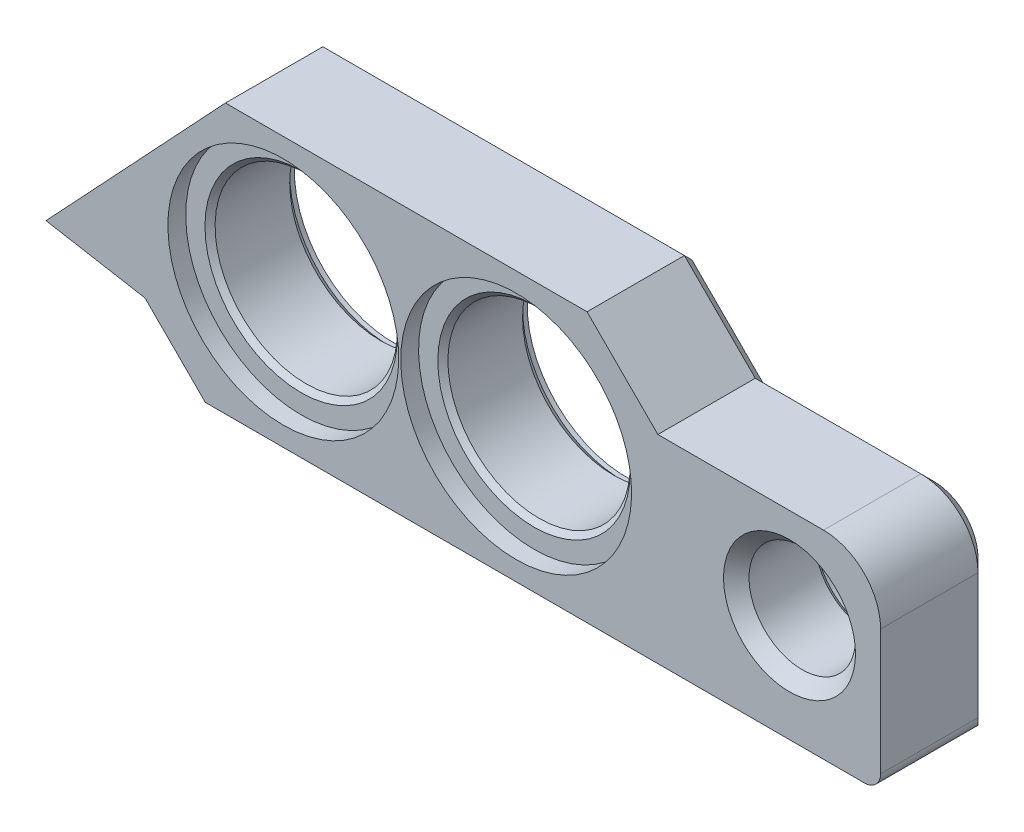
ISO-10303-21;
HEADER;
FILE_DESCRIPTION(('STEP AP214'),'2;1');
FILE_NAME('part.step','',(''),(''),'','','');
FILE_SCHEMA(('AUTOMOTIVE_DESIGN { 1 0 10303 214 1 1 1 1 }'));
ENDSEC;
DATA;
#1=APPLICATION_CONTEXT('core data for automotive mechanical design processes');
#2=APPLICATION_PROTOCOL_DEFINITION('international standard','automotive_design',2000,#1);
#3=PRODUCT_CONTEXT('',#1,'mechanical');
#4=PRODUCT('Part','Part','',(#3));
#5=PRODUCT_RELATED_PRODUCT_CATEGORY('part','',(#4));
#6=PRODUCT_DEFINITION_FORMATION('','',#4);
#7=PRODUCT_DEFINITION_CONTEXT('part definition',#1,'design');
#8=PRODUCT_DEFINITION('design','',#6,#7);
#9=PRODUCT_DEFINITION_SHAPE('','',#8);
#10=(LENGTH_UNIT() NAMED_UNIT(*) SI_UNIT(.MILLI.,.METRE.));
#11=(NAMED_UNIT(*) PLANE_ANGLE_UNIT() SI_UNIT($,.RADIAN.));
#12=(NAMED_UNIT(*) SI_UNIT($,.STERADIAN.) SOLID_ANGLE_UNIT());
#13=UNCERTAINTY_MEASURE_WITH_UNIT(LENGTH_MEASURE(1.E-05),#10,'distance_accuracy_value','');
#14=(GEOMETRIC_REPRESENTATION_CONTEXT(3) GLOBAL_UNCERTAINTY_ASSIGNED_CONTEXT((#13)) GLOBAL_UNIT_ASSIGNED_CONTEXT((#10,
#11,#12)) REPRESENTATION_CONTEXT('',''));
#15=CARTESIAN_POINT('',(0.,0.,0.));
#16=DIRECTION('',(0.,0.,1.));
#17=DIRECTION('',(1.,0.,0.));
#18=AXIS2_PLACEMENT_3D('',#15,#16,#17);
#19=CARTESIAN_POINT('',(-78.2694281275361,37.4141999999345,102.518069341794));
#20=DIRECTION('',(0.,1.41706785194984E-12,-1.));
#21=DIRECTION('',(0.,1.,1.41706785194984E-12));
#22=AXIS2_PLACEMENT_3D('',#19,#20,#21);
#23=CYLINDRICAL_SURFACE('',#22,3.3377);
#24=CARTESIAN_POINT('',(-78.2694281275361,37.4141999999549,88.1458282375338));
#25=DIRECTION('',(0.,1.41329641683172E-12,-1.));
#26=DIRECTION('',(0.,1.,1.41329641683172E-12));
#27=AXIS2_PLACEMENT_3D('',#24,#25,#26);
#28=CIRCLE('',#27,3.3377);
#29=CARTESIAN_POINT('',(-78.2694281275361,40.7518999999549,88.1458282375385));
#30=VERTEX_POINT('',#29);
#31=EDGE_CURVE('E75',#30,#30,#28,.T.);
#32=ORIENTED_EDGE('',*,*,#31,.T.);
#33=EDGE_LOOP('',(#32));
#34=FACE_BOUND('',#33,.T.);
#35=CARTESIAN_POINT('',(-78.2694281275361,37.414199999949,92.2776282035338));
#36=DIRECTION('',(0.,1.4137997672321E-12,-1.));
#37=DIRECTION('',(0.,1.,1.41379976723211E-12));
#38=AXIS2_PLACEMENT_3D('',#35,#36,#37);
#39=CIRCLE('',#38,3.3377);
#40=CARTESIAN_POINT('',(-78.2694281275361,40.751899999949,92.2776282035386));
#41=VERTEX_POINT('',#40);
#42=EDGE_CURVE('E382',#41,#41,#39,.F.);
#43=ORIENTED_EDGE('',*,*,#42,.T.);
#44=EDGE_LOOP('',(#43));
#45=FACE_BOUND('',#44,.T.);
#46=ADVANCED_FACE('F66',(#34,#45),#23,.F.);
#47=CARTESIAN_POINT('',(-110.019428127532,39.1266999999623,86.1688281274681));
#48=DIRECTION('',(0.,-1.41722377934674E-12,1.));
#49=DIRECTION('',(0.,-1.,-1.41722377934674E-12));
#50=AXIS2_PLACEMENT_3D('',#47,#48,#49);
#51=CYLINDRICAL_SURFACE('',#50,5.71499999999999);
#52=CARTESIAN_POINT('',(-110.019428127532,39.1266999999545,91.6425281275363));
#53=DIRECTION('',(0.,-1.42056095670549E-12,1.));
#54=DIRECTION('',(0.,-1.,-1.42056095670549E-12));
#55=AXIS2_PLACEMENT_3D('',#52,#53,#54);
#56=CIRCLE('',#55,5.71499999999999);
#57=CARTESIAN_POINT('',(-110.019428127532,33.4116999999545,91.6425281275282));
#58=VERTEX_POINT('',#57);
#59=EDGE_CURVE('E370',#58,#58,#56,.T.);
#60=ORIENTED_EDGE('',*,*,#59,.T.);
#61=EDGE_LOOP('',(#60));
#62=FACE_BOUND('',#61,.T.);
#63=CARTESIAN_POINT('',(-110.019428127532,39.1266999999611,86.9618281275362));
#64=DIRECTION('',(0.,1.41329663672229E-12,-1.));
#65=DIRECTION('',(0.,1.,1.41329663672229E-12));
#66=AXIS2_PLACEMENT_3D('',#63,#64,#65);
#67=CIRCLE('',#66,5.71499999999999);
#68=CARTESIAN_POINT('',(-110.019428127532,44.8416999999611,86.9618281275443));
#69=VERTEX_POINT('',#68);
#70=EDGE_CURVE('E254',#69,#69,#67,.T.);
#71=ORIENTED_EDGE('',*,*,#70,.T.);
#72=EDGE_LOOP('',(#71));
#73=FACE_BOUND('',#72,.T.);
#74=ADVANCED_FACE('F515',(#62,#73),#51,.F.);
#75=CARTESIAN_POINT('',(-95.4144281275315,39.1266999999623,86.1688281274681));
#76=DIRECTION('',(0.,-1.41722377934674E-12,1.));
#77=DIRECTION('',(0.,-1.,-1.41722377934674E-12));
#78=AXIS2_PLACEMENT_3D('',#75,#76,#77);
#79=CYLINDRICAL_SURFACE('',#78,5.71499999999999);
#80=CARTESIAN_POINT('',(-95.4144281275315,39.1266999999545,91.6425281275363));
#81=DIRECTION('',(0.,-1.42056095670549E-12,1.));
#82=DIRECTION('',(0.,-1.,-1.42056095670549E-12));
#83=AXIS2_PLACEMENT_3D('',#80,#81,#82);
#84=CIRCLE('',#83,5.71499999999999);
#85=CARTESIAN_POINT('',(-95.4144281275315,33.4116999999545,91.6425281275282));
#86=VERTEX_POINT('',#85);
#87=EDGE_CURVE('E378',#86,#86,#84,.T.);
#88=ORIENTED_EDGE('',*,*,#87,.T.);
#89=EDGE_LOOP('',(#88));
#90=FACE_BOUND('',#89,.T.);
#91=CARTESIAN_POINT('',(-95.4144281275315,39.1266999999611,86.9618281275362));
#92=DIRECTION('',(0.,1.41329663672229E-12,-1.));
#93=DIRECTION('',(0.,1.,1.41329663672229E-12));
#94=AXIS2_PLACEMENT_3D('',#91,#92,#93);
#95=CIRCLE('',#94,5.71499999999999);
#96=CARTESIAN_POINT('',(-95.4144281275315,44.8416999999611,86.9618281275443));
#97=VERTEX_POINT('',#96);
#98=EDGE_CURVE('E258',#97,#97,#95,.T.);
#99=ORIENTED_EDGE('',*,*,#98,.T.);
#100=EDGE_LOOP('',(#99));
#101=FACE_BOUND('',#100,.T.);
#102=ADVANCED_FACE('F520',(#90,#101),#79,.F.);
#103=CARTESIAN_POINT('',(-97.3194281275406,30.4291999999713,86.1688281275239));
#104=DIRECTION('',(0.,-1.41706785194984E-12,1.));
#105=DIRECTION('',(-1.,7.15679251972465E-13,0.));
#106=AXIS2_PLACEMENT_3D('',#103,#104,#105);
#107=PLANE('',#106);
#108=CARTESIAN_POINT('',(-78.2694281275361,37.4141999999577,86.1688281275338));
#109=DIRECTION('',(0.,1.41706785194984E-12,-1.));
#110=DIRECTION('',(0.,1.,1.41706785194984E-12));
#111=AXIS2_PLACEMENT_3D('',#108,#109,#110);
#112=CIRCLE('',#111,3.687699);
#113=CARTESIAN_POINT('',(-78.2694281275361,41.1018989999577,86.1688281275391));
#114=VERTEX_POINT('',#113);
#115=EDGE_CURVE('E324',#114,#114,#112,.T.);
#116=ORIENTED_EDGE('',*,*,#115,.F.);
#117=EDGE_LOOP('',(#116));
#118=FACE_BOUND('',#117,.T.);
#119=DIRECTION('',(0.707106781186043,-0.707106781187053,-1.0020182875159E-12));
#120=VECTOR('',#119,1.);
#121=CARTESIAN_POINT('',(-86.1376135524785,41.6110145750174,86.1688281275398));
#122=LINE('',#121,#120);
#123=CARTESIAN_POINT('',(-91.3007989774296,46.7741999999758,86.1688281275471));
#124=VERTEX_POINT('',#123);
#125=CARTESIAN_POINT('',(-86.8557989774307,42.3291999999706,86.1688281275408));
#126=VERTEX_POINT('',#125);
#127=EDGE_CURVE('E281',#124,#126,#122,.T.);
#128=ORIENTED_EDGE('',*,*,#127,.T.);
#129=DIRECTION('',(1.,-7.15679251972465E-13,0.));
#130=VECTOR('',#129,1.);
#131=CARTESIAN_POINT('',(-76.1365272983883,42.329199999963,86.1688281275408));
#132=LINE('',#131,#130);
#133=CARTESIAN_POINT('',(-76.1365272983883,42.3291999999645,86.1688281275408));
#134=VERTEX_POINT('',#133);
#135=EDGE_CURVE('E287',#126,#134,#132,.T.);
#136=ORIENTED_EDGE('',*,*,#135,.T.);
#137=CARTESIAN_POINT('',(-76.1365272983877,39.547100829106,86.1688281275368));
#138=DIRECTION('',(0.,-1.41706785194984E-12,1.));
#139=DIRECTION('',(0.,-1.,-1.41706785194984E-12));
#140=AXIS2_PLACEMENT_3D('',#137,#138,#139);
#141=CIRCLE('',#140,2.78209917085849);
#142=CARTESIAN_POINT('',(-73.3544281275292,39.547100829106,86.1688281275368));
#143=VERTEX_POINT('',#142);
#144=EDGE_CURVE('E284',#134,#143,#141,.F.);
#145=ORIENTED_EDGE('',*,*,#144,.T.);
#146=DIRECTION('',(0.,-1.,-1.41706785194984E-12));
#147=VECTOR('',#146,1.);
#148=CARTESIAN_POINT('',(-73.3544281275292,30.4291999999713,86.1688281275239));
#149=LINE('',#148,#147);
#150=CARTESIAN_POINT('',(-73.3544281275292,31.4791999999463,86.1688281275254));
#151=VERTEX_POINT('',#150);
#152=EDGE_CURVE('E265',#143,#151,#149,.T.);
#153=ORIENTED_EDGE('',*,*,#152,.T.);
#154=DIRECTION('',(-1.,0.,0.));
#155=VECTOR('',#154,1.);
#156=CARTESIAN_POINT('',(-97.3194281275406,31.4791999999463,86.1688281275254));
#157=LINE('',#156,#155);
#158=CARTESIAN_POINT('',(-114.581358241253,31.4791999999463,86.1688281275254));
#159=VERTEX_POINT('',#158);
#160=EDGE_CURVE('E262',#151,#159,#157,.T.);
#161=ORIENTED_EDGE('',*,*,#160,.T.);
#162=DIRECTION('',(-0.707106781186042,0.707106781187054,1.0020182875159E-12));
#163=VECTOR('',#162,1.);
#164=CARTESIAN_POINT('',(-105.425393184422,22.3232349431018,86.1688281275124));
#165=LINE('',#164,#163);
#166=CARTESIAN_POINT('',(-118.30581037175,35.2036521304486,86.1688281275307));
#167=VERTEX_POINT('',#166);
#168=EDGE_CURVE('E269',#159,#167,#165,.T.);
#169=ORIENTED_EDGE('',*,*,#168,.T.);
#170=DIRECTION('',(-0.984807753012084,0.173648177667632,2.46071250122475E-13));
#171=VECTOR('',#170,1.);
#172=CARTESIAN_POINT('',(-97.1357655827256,31.4708020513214,86.1688281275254));
#173=LINE('',#172,#171);
#174=CARTESIAN_POINT('',(-123.311619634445,36.0863113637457,86.168828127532));
#175=VERTEX_POINT('',#174);
#176=EDGE_CURVE('E272',#167,#175,#173,.T.);
#177=ORIENTED_EDGE('',*,*,#176,.T.);
#178=DIRECTION('',(0.68351636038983,0.729935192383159,1.034367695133E-12));
#179=VECTOR('',#178,1.);
#180=CARTESIAN_POINT('',(-113.066320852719,47.0273869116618,86.1688281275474));
#181=LINE('',#180,#179);
#182=CARTESIAN_POINT('',(-113.303406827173,46.7741999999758,86.1688281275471));
#183=VERTEX_POINT('',#182);
#184=EDGE_CURVE('E275',#175,#183,#181,.T.);
#185=ORIENTED_EDGE('',*,*,#184,.T.);
#186=DIRECTION('',(1.,0.,0.));
#187=VECTOR('',#186,1.);
#188=CARTESIAN_POINT('',(-90.9694281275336,46.7741999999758,86.1688281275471));
#189=LINE('',#188,#187);
#190=EDGE_CURVE('E278',#183,#124,#189,.T.);
#191=ORIENTED_EDGE('',*,*,#190,.T.);
#192=EDGE_LOOP('',(#128,#136,#145,#153,#161,#169,#177,#185,#191));
#193=FACE_BOUND('',#192,.T.);
#194=CARTESIAN_POINT('',(-110.019428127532,39.1266999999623,86.1688281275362));
#195=DIRECTION('',(0.,1.41706785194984E-12,-1.));
#196=DIRECTION('',(0.,1.,1.41706785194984E-12));
#197=AXIS2_PLACEMENT_3D('',#194,#195,#196);
#198=CIRCLE('',#197,6.21499999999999);
#199=CARTESIAN_POINT('',(-110.019428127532,45.3416999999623,86.1688281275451));
#200=VERTEX_POINT('',#199);
#201=EDGE_CURVE('E420',#200,#200,#198,.T.);
#202=ORIENTED_EDGE('',*,*,#201,.F.);
#203=EDGE_LOOP('',(#202));
#204=FACE_BOUND('',#203,.T.);
#205=CARTESIAN_POINT('',(-95.4144281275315,39.1266999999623,86.1688281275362));
#206=DIRECTION('',(0.,1.41706785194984E-12,-1.));
#207=DIRECTION('',(0.,1.,1.41706785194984E-12));
#208=AXIS2_PLACEMENT_3D('',#205,#206,#207);
#209=CIRCLE('',#208,6.21499999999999);
#210=CARTESIAN_POINT('',(-95.4144281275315,45.3416999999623,86.1688281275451));
#211=VERTEX_POINT('',#210);
#212=EDGE_CURVE('E435',#211,#211,#209,.T.);
#213=ORIENTED_EDGE('',*,*,#212,.F.);
#214=EDGE_LOOP('',(#213));
#215=FACE_BOUND('',#214,.T.);
#216=ADVANCED_FACE('F460',(#118,#193,#204,#215),#107,.F.);
#217=CARTESIAN_POINT('',(-100.494428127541,30.4291999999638,93.0776281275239));
#218=DIRECTION('',(0.,1.41722377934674E-12,-1.));
#219=DIRECTION('',(7.15679251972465E-13,1.,1.41722377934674E-12));
#220=AXIS2_PLACEMENT_3D('',#217,#218,#219);
#221=PLANE('',#220);
#222=CARTESIAN_POINT('',(-78.2694281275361,37.4141999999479,93.0776281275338));
#223=DIRECTION('',(0.,1.41722377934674E-12,-1.));
#224=DIRECTION('',(0.,1.,1.41722377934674E-12));
#225=AXIS2_PLACEMENT_3D('',#222,#223,#224);
#226=CIRCLE('',#225,4.13769992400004);
#227=CARTESIAN_POINT('',(-78.2694281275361,41.5518999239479,93.0776281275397));
#228=VERTEX_POINT('',#227);
#229=EDGE_CURVE('E386',#228,#228,#226,.T.);
#230=ORIENTED_EDGE('',*,*,#229,.T.);
#231=EDGE_LOOP('',(#230));
#232=FACE_BOUND('',#231,.T.);
#233=CARTESIAN_POINT('',(-95.4144281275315,39.1266999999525,93.0776281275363));
#234=DIRECTION('',(0.,-1.41722377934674E-12,1.));
#235=DIRECTION('',(0.,-1.,-1.41722377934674E-12));
#236=AXIS2_PLACEMENT_3D('',#233,#234,#235);
#237=CIRCLE('',#236,7.239);
#238=CARTESIAN_POINT('',(-95.4144281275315,31.8876999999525,93.077628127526));
#239=VERTEX_POINT('',#238);
#240=EDGE_CURVE('E421',#239,#239,#237,.T.);
#241=ORIENTED_EDGE('',*,*,#240,.F.);
#242=EDGE_LOOP('',(#241));
#243=FACE_BOUND('',#242,.T.);
#244=CARTESIAN_POINT('',(-110.019428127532,39.1266999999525,93.0776281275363));
#245=DIRECTION('',(0.,-1.41722377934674E-12,1.));
#246=DIRECTION('',(0.,-1.,-1.41722377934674E-12));
#247=AXIS2_PLACEMENT_3D('',#244,#245,#246);
#248=CIRCLE('',#247,7.239);
#249=CARTESIAN_POINT('',(-110.019428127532,31.8876999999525,93.077628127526));
#250=VERTEX_POINT('',#249);
#251=EDGE_CURVE('E415',#250,#250,#248,.T.);
#252=ORIENTED_EDGE('',*,*,#251,.F.);
#253=EDGE_LOOP('',(#252));
#254=FACE_BOUND('',#253,.T.);
#255=DIRECTION('',(1.,0.,0.));
#256=VECTOR('',#255,1.);
#257=CARTESIAN_POINT('',(-100.494428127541,30.6791999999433,93.0776281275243));
#258=LINE('',#257,#256);
#259=CARTESIAN_POINT('',(-114.912729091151,30.6791999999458,93.0776281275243));
#260=VERTEX_POINT('',#259);
#261=CARTESIAN_POINT('',(-73.5544281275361,30.6791999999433,93.0776281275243));
#262=VERTEX_POINT('',#261);
#263=EDGE_CURVE('E227',#260,#262,#258,.T.);
#264=ORIENTED_EDGE('',*,*,#263,.T.);
#265=CARTESIAN_POINT('',(-73.5544281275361,31.6791999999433,93.0776281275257));
#266=DIRECTION('',(0.,1.41722377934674E-12,-1.));
#267=DIRECTION('',(0.,1.,1.41722377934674E-12));
#268=AXIS2_PLACEMENT_3D('',#265,#266,#267);
#269=CIRCLE('',#268,1.);
#270=CARTESIAN_POINT('',(-72.5544281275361,31.6791999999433,93.0776281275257));
#271=VERTEX_POINT('',#270);
#272=EDGE_CURVE('E356',#262,#271,#269,.F.);
#273=ORIENTED_EDGE('',*,*,#272,.T.);
#274=DIRECTION('',(0.,1.,1.41891425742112E-12));
#275=VECTOR('',#274,1.);
#276=CARTESIAN_POINT('',(-72.5544281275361,36.7791999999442,93.0776281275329));
#277=LINE('',#276,#275);
#278=CARTESIAN_POINT('',(-72.5544281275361,39.5471008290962,93.0776281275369));
#279=VERTEX_POINT('',#278);
#280=EDGE_CURVE('E211',#271,#279,#277,.T.);
#281=ORIENTED_EDGE('',*,*,#280,.T.);
#282=CARTESIAN_POINT('',(-76.1365272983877,39.5471008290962,93.0776281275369));
#283=DIRECTION('',(0.,-1.41722377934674E-12,1.));
#284=DIRECTION('',(0.,1.,1.41722377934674E-12));
#285=AXIS2_PLACEMENT_3D('',#282,#283,#284);
#286=CIRCLE('',#285,3.58209917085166);
#287=CARTESIAN_POINT('',(-76.1365272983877,43.1291999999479,93.0776281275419));
#288=VERTEX_POINT('',#287);
#289=EDGE_CURVE('E200',#279,#288,#286,.T.);
#290=ORIENTED_EDGE('',*,*,#289,.T.);
#291=DIRECTION('',(-1.,7.1700502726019E-13,0.));
#292=VECTOR('',#291,1.);
#293=CARTESIAN_POINT('',(-86.5244281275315,43.1291999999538,93.0776281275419));
#294=LINE('',#293,#292);
#295=CARTESIAN_POINT('',(-86.5244281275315,43.1291999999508,93.0776281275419));
#296=VERTEX_POINT('',#295);
#297=EDGE_CURVE('E198',#288,#296,#294,.T.);
#298=ORIENTED_EDGE('',*,*,#297,.T.);
#299=DIRECTION('',(-0.707106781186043,0.707106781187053,1.00212854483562E-12));
#300=VECTOR('',#299,1.);
#301=CARTESIAN_POINT('',(-87.1594281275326,43.7641999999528,93.0776281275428));
#302=LINE('',#301,#300);
#303=CARTESIAN_POINT('',(-90.9694281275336,47.5741999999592,93.0776281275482));
#304=VERTEX_POINT('',#303);
#305=EDGE_CURVE('E178',#296,#304,#302,.T.);
#306=ORIENTED_EDGE('',*,*,#305,.T.);
#307=DIRECTION('',(-1.,0.,0.));
#308=VECTOR('',#307,1.);
#309=CARTESIAN_POINT('',(-113.650269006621,47.5741999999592,93.0776281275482));
#310=LINE('',#309,#308);
#311=CARTESIAN_POINT('',(-113.650269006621,47.5741999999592,93.0776281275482));
#312=VERTEX_POINT('',#311);
#313=EDGE_CURVE('E194',#304,#312,#310,.T.);
#314=ORIENTED_EDGE('',*,*,#313,.T.);
#315=DIRECTION('',(-0.683516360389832,-0.729935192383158,-1.02894114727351E-12));
#316=VECTOR('',#315,1.);
#317=CARTESIAN_POINT('',(-114.839505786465,46.304199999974,93.0776281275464));
#318=LINE('',#317,#316);
#319=CARTESIAN_POINT('',(-124.905171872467,35.554956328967,93.0776281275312));
#320=VERTEX_POINT('',#319);
#321=EDGE_CURVE('E206',#312,#320,#318,.T.);
#322=ORIENTED_EDGE('',*,*,#321,.T.);
#323=DIRECTION('',(0.984807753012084,-0.173648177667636,-2.4607125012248E-13));
#324=VECTOR('',#323,1.);
#325=CARTESIAN_POINT('',(-123.865493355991,35.3716329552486,93.0776281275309));
#326=LINE('',#325,#324);
#327=CARTESIAN_POINT('',(-118.693135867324,34.4596067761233,93.0776281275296));
#328=VERTEX_POINT('',#327);
#329=EDGE_CURVE('E230',#320,#328,#326,.T.);
#330=ORIENTED_EDGE('',*,*,#329,.T.);
#331=DIRECTION('',(0.707106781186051,-0.707106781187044,-1.00201828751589E-12));
#332=VECTOR('',#331,1.);
#333=CARTESIAN_POINT('',(-114.751117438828,30.5175883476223,93.0776281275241));
#334=LINE('',#333,#332);
#335=EDGE_CURVE('E234',#328,#260,#334,.T.);
#336=ORIENTED_EDGE('',*,*,#335,.T.);
#337=EDGE_LOOP('',(#264,#273,#281,#290,#298,#306,#314,#322,#330,#336));
#338=FACE_BOUND('',#337,.T.);
#339=ADVANCED_FACE('F192',(#232,#243,#254,#338),#221,.F.);
#340=CARTESIAN_POINT('',(-78.2694281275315,43.1292000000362,30.7583099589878));
#341=DIRECTION('',(7.15679251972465E-13,1.,1.41722377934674E-12));
#342=DIRECTION('',(0.,-1.41722377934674E-12,1.));
#343=AXIS2_PLACEMENT_3D('',#340,#341,#342);
#344=PLANE('',#343);
#345=DIRECTION('',(0.,-1.41722377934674E-12,1.));
#346=VECTOR('',#345,1.);
#347=CARTESIAN_POINT('',(-76.1365272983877,43.1291999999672,79.4240034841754));
#348=LINE('',#347,#346);
#349=CARTESIAN_POINT('',(-76.1365272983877,43.1291999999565,86.9688281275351));
#350=VERTEX_POINT('',#349);
#351=EDGE_CURVE('E412',#350,#288,#348,.T.);
#352=ORIENTED_EDGE('',*,*,#351,.F.);
#353=DIRECTION('',(-1.,7.15679251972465E-13,0.));
#354=VECTOR('',#353,1.);
#355=CARTESIAN_POINT('',(-86.5244281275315,43.1291999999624,86.9688281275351));
#356=LINE('',#355,#354);
#357=CARTESIAN_POINT('',(-86.5244281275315,43.1291999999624,86.9688281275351));
#358=VERTEX_POINT('',#357);
#359=EDGE_CURVE('E291',#350,#358,#356,.T.);
#360=ORIENTED_EDGE('',*,*,#359,.T.);
#361=DIRECTION('',(0.,1.41722377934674E-12,-1.));
#362=VECTOR('',#361,1.);
#363=CARTESIAN_POINT('',(-86.5244281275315,43.1292000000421,30.7583099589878));
#364=LINE('',#363,#362);
#365=EDGE_CURVE('E217',#296,#358,#364,.T.);
#366=ORIENTED_EDGE('',*,*,#365,.F.);
#367=ORIENTED_EDGE('',*,*,#297,.F.);
#368=EDGE_LOOP('',(#352,#360,#366,#367));
#369=FACE_BOUND('',#368,.T.);
#370=ADVANCED_FACE('F449',(#369),#344,.T.);
#371=CARTESIAN_POINT('',(-125.007184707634,35.4460156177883,30.758309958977));
#372=DIRECTION('',(-0.72993519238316,0.68351636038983,9.68695639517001E-13));
#373=DIRECTION('',(0.68351636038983,0.72993519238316,1.034367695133E-12));
#374=AXIS2_PLACEMENT_3D('',#371,#372,#373);
#375=PLANE('',#374);
#376=DIRECTION('',(0.,-1.41722377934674E-12,1.));
#377=VECTOR('',#376,1.);
#378=CARTESIAN_POINT('',(-113.650269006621,47.574200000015,53.7071700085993));
#379=LINE('',#378,#377);
#380=CARTESIAN_POINT('',(-113.650269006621,47.5741999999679,86.9688281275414));
#381=VERTEX_POINT('',#380);
#382=EDGE_CURVE('E204',#381,#312,#379,.T.);
#383=ORIENTED_EDGE('',*,*,#382,.F.);
#384=DIRECTION('',(-0.68351636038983,-0.72993519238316,-1.034367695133E-12));
#385=VECTOR('',#384,1.);
#386=CARTESIAN_POINT('',(-124.905171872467,35.5549563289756,86.9688281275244));
#387=LINE('',#386,#385);
#388=CARTESIAN_POINT('',(-124.905171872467,35.5549563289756,86.9688281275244));
#389=VERTEX_POINT('',#388);
#390=EDGE_CURVE('E303',#381,#389,#387,.T.);
#391=ORIENTED_EDGE('',*,*,#390,.T.);
#392=DIRECTION('',(0.,1.41708994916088E-12,-1.));
#393=VECTOR('',#392,1.);
#394=CARTESIAN_POINT('',(-124.905171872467,35.5549563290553,30.7583099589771));
#395=LINE('',#394,#393);
#396=EDGE_CURVE('E242',#320,#389,#395,.T.);
#397=ORIENTED_EDGE('',*,*,#396,.F.);
#398=ORIENTED_EDGE('',*,*,#321,.F.);
#399=EDGE_LOOP('',(#383,#391,#397,#398));
#400=FACE_BOUND('',#399,.T.);
#401=ADVANCED_FACE('F472',(#400),#375,.T.);
#402=CARTESIAN_POINT('',(-114.751117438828,30.5175883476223,93.0776281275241));
#403=DIRECTION('',(0.707106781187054,0.707106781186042,1.00201828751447E-12));
#404=DIRECTION('',(0.707106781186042,-0.707106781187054,-1.0020182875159E-12));
#405=AXIS2_PLACEMENT_3D('',#402,#403,#404);
#406=PLANE('',#405);
#407=DIRECTION('',(0.,1.41706785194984E-12,-1.));
#408=VECTOR('',#407,1.);
#409=CARTESIAN_POINT('',(-118.693135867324,34.4596067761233,93.0776281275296));
#410=LINE('',#409,#408);
#411=CARTESIAN_POINT('',(-118.693135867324,34.4596067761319,86.9688281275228));
#412=VERTEX_POINT('',#411);
#413=EDGE_CURVE('E238',#328,#412,#410,.T.);
#414=ORIENTED_EDGE('',*,*,#413,.T.);
#415=DIRECTION('',(0.707106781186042,-0.707106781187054,-1.0020182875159E-12));
#416=VECTOR('',#415,1.);
#417=CARTESIAN_POINT('',(-114.751117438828,30.517588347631,86.9688281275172));
#418=LINE('',#417,#416);
#419=CARTESIAN_POINT('',(-114.912729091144,30.679199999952,86.9688281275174));
#420=VERTEX_POINT('',#419);
#421=EDGE_CURVE('E309',#412,#420,#418,.T.);
#422=ORIENTED_EDGE('',*,*,#421,.T.);
#423=DIRECTION('',(0.,-1.41722377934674E-12,1.));
#424=VECTOR('',#423,1.);
#425=CARTESIAN_POINT('',(-114.912729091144,30.6791999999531,86.1688281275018));
#426=LINE('',#425,#424);
#427=EDGE_CURVE('E224',#420,#260,#426,.T.);
#428=ORIENTED_EDGE('',*,*,#427,.T.);
#429=ORIENTED_EDGE('',*,*,#335,.F.);
#430=EDGE_LOOP('',(#414,#422,#428,#429));
#431=FACE_BOUND('',#430,.T.);
#432=ADVANCED_FACE('F488',(#431),#406,.F.);
#433=CARTESIAN_POINT('',(-118.693135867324,34.4596067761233,93.0776281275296));
#434=DIRECTION('',(0.173648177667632,0.984807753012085,1.39553940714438E-12));
#435=DIRECTION('',(0.984807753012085,-0.173648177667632,-2.46071250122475E-13));
#436=AXIS2_PLACEMENT_3D('',#433,#434,#435);
#437=PLANE('',#436);
#438=ORIENTED_EDGE('',*,*,#396,.T.);
#439=DIRECTION('',(0.984807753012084,-0.173648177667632,-2.46071250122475E-13));
#440=VECTOR('',#439,1.);
#441=CARTESIAN_POINT('',(-118.693135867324,34.4596067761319,86.9688281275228));
#442=LINE('',#441,#440);
#443=EDGE_CURVE('E306',#389,#412,#442,.T.);
#444=ORIENTED_EDGE('',*,*,#443,.T.);
#445=ORIENTED_EDGE('',*,*,#413,.F.);
#446=ORIENTED_EDGE('',*,*,#329,.F.);
#447=EDGE_LOOP('',(#438,#444,#445,#446));
#448=FACE_BOUND('',#447,.T.);
#449=ADVANCED_FACE('F484',(#448),#437,.F.);
#450=CARTESIAN_POINT('',(-114.912729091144,30.6791999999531,86.1688281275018));
#451=DIRECTION('',(0.,1.,1.41722377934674E-12));
#452=DIRECTION('',(0.,-1.41722377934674E-12,1.));
#453=AXIS2_PLACEMENT_3D('',#450,#451,#452);
#454=PLANE('',#453);
#455=DIRECTION('',(1.,0.,0.));
#456=VECTOR('',#455,1.);
#457=CARTESIAN_POINT('',(-114.912729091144,30.679199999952,86.9688281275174));
#458=LINE('',#457,#456);
#459=CARTESIAN_POINT('',(-73.5544281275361,30.679199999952,86.9688281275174));
#460=VERTEX_POINT('',#459);
#461=EDGE_CURVE('E315',#420,#460,#458,.T.);
#462=ORIENTED_EDGE('',*,*,#461,.T.);
#463=DIRECTION('',(0.,-1.41722377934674E-12,1.));
#464=VECTOR('',#463,1.);
#465=CARTESIAN_POINT('',(-73.5544281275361,30.6791999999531,86.1688281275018));
#466=LINE('',#465,#464);
#467=EDGE_CURVE('E319',#460,#262,#466,.T.);
#468=ORIENTED_EDGE('',*,*,#467,.T.);
#469=ORIENTED_EDGE('',*,*,#263,.F.);
#470=ORIENTED_EDGE('',*,*,#427,.F.);
#471=EDGE_LOOP('',(#462,#468,#469,#470));
#472=FACE_BOUND('',#471,.T.);
#473=ADVANCED_FACE('F492',(#472),#454,.F.);
#474=CARTESIAN_POINT('',(-72.5544281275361,30.6791999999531,86.1688281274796));
#475=DIRECTION('',(-1.,0.,0.));
#476=DIRECTION('',(0.,0.,1.));
#477=AXIS2_PLACEMENT_3D('',#474,#475,#476);
#478=PLANE('',#477);
#479=ORIENTED_EDGE('',*,*,#280,.F.);
#480=DIRECTION('',(0.,-1.41722377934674E-12,1.));
#481=VECTOR('',#480,1.);
#482=CARTESIAN_POINT('',(-72.5544281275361,31.6791999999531,86.168828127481));
#483=LINE('',#482,#481);
#484=CARTESIAN_POINT('',(-72.5544281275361,31.679199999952,86.9688281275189));
#485=VERTEX_POINT('',#484);
#486=EDGE_CURVE('E90',#271,#485,#483,.F.);
#487=ORIENTED_EDGE('',*,*,#486,.T.);
#488=DIRECTION('',(0.,1.,1.41706785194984E-12));
#489=VECTOR('',#488,1.);
#490=CARTESIAN_POINT('',(-72.5544281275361,30.679199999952,86.9688281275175));
#491=LINE('',#490,#489);
#492=CARTESIAN_POINT('',(-72.5544281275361,39.5471008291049,86.96882812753));
#493=VERTEX_POINT('',#492);
#494=EDGE_CURVE('E312',#485,#493,#491,.T.);
#495=ORIENTED_EDGE('',*,*,#494,.T.);
#496=DIRECTION('',(0.,-1.41722377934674E-12,1.));
#497=VECTOR('',#496,1.);
#498=CARTESIAN_POINT('',(-72.5544281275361,39.547100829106,86.1688281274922));
#499=LINE('',#498,#497);
#500=EDGE_CURVE('E220',#493,#279,#499,.T.);
#501=ORIENTED_EDGE('',*,*,#500,.T.);
#502=EDGE_LOOP('',(#479,#487,#495,#501));
#503=FACE_BOUND('',#502,.T.);
#504=ADVANCED_FACE('F441',(#503),#478,.F.);
#505=CARTESIAN_POINT('',(-113.650269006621,47.574200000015,53.7071700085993));
#506=DIRECTION('',(0.,1.,1.41722377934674E-12));
#507=DIRECTION('',(0.,-1.41722377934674E-12,1.));
#508=AXIS2_PLACEMENT_3D('',#505,#506,#507);
#509=PLANE('',#508);
#510=DIRECTION('',(0.,-1.41722377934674E-12,1.));
#511=VECTOR('',#510,1.);
#512=CARTESIAN_POINT('',(-90.9694281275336,47.574199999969,86.1688281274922));
#513=LINE('',#512,#511);
#514=CARTESIAN_POINT('',(-90.9694281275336,47.5741999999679,86.9688281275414));
#515=VERTEX_POINT('',#514);
#516=EDGE_CURVE('E174',#515,#304,#513,.T.);
#517=ORIENTED_EDGE('',*,*,#516,.F.);
#518=DIRECTION('',(-1.,0.,0.));
#519=VECTOR('',#518,1.);
#520=CARTESIAN_POINT('',(-113.650269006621,47.5741999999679,86.9688281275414));
#521=LINE('',#520,#519);
#522=EDGE_CURVE('E300',#515,#381,#521,.T.);
#523=ORIENTED_EDGE('',*,*,#522,.T.);
#524=ORIENTED_EDGE('',*,*,#382,.T.);
#525=ORIENTED_EDGE('',*,*,#313,.F.);
#526=EDGE_LOOP('',(#517,#523,#524,#525));
#527=FACE_BOUND('',#526,.T.);
#528=ADVANCED_FACE('F202',(#527),#509,.T.);
#529=CARTESIAN_POINT('',(-95.4144281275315,39.1266999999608,87.1688281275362));
#530=DIRECTION('',(0.,1.41706785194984E-12,-1.));
#531=DIRECTION('',(0.,1.,1.41706785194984E-12));
#532=AXIS2_PLACEMENT_3D('',#529,#530,#531);
#533=CYLINDRICAL_SURFACE('',#532,6.21499999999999);
#534=CARTESIAN_POINT('',(-95.4144281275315,39.1266999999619,86.4618281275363));
#535=DIRECTION('',(0.,1.41329663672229E-12,-1.));
#536=DIRECTION('',(0.,1.,1.41329663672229E-12));
#537=AXIS2_PLACEMENT_3D('',#534,#535,#536);
#538=CIRCLE('',#537,6.21499999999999);
#539=CARTESIAN_POINT('',(-95.4144281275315,45.3416999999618,86.461828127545));
#540=VERTEX_POINT('',#539);
#541=EDGE_CURVE('E250',#540,#540,#538,.F.);
#542=ORIENTED_EDGE('',*,*,#541,.T.);
#543=EDGE_LOOP('',(#542));
#544=FACE_BOUND('',#543,.T.);
#545=ORIENTED_EDGE('',*,*,#212,.T.);
#546=EDGE_LOOP('',(#545));
#547=FACE_BOUND('',#546,.T.);
#548=ADVANCED_FACE('F549',(#544,#547),#533,.F.);
#549=CARTESIAN_POINT('',(-110.019428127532,39.1266999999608,87.1688281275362));
#550=DIRECTION('',(0.,1.41706785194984E-12,-1.));
#551=DIRECTION('',(0.,1.,1.41706785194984E-12));
#552=AXIS2_PLACEMENT_3D('',#549,#550,#551);
#553=CYLINDRICAL_SURFACE('',#552,6.21499999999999);
#554=CARTESIAN_POINT('',(-110.019428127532,39.1266999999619,86.4618281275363));
#555=DIRECTION('',(0.,1.41329663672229E-12,-1.));
#556=DIRECTION('',(0.,1.,1.41329663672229E-12));
#557=AXIS2_PLACEMENT_3D('',#554,#555,#556);
#558=CIRCLE('',#557,6.21499999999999);
#559=CARTESIAN_POINT('',(-110.019428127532,45.3416999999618,86.461828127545));
#560=VERTEX_POINT('',#559);
#561=EDGE_CURVE('E246',#560,#560,#558,.F.);
#562=ORIENTED_EDGE('',*,*,#561,.T.);
#563=EDGE_LOOP('',(#562));
#564=FACE_BOUND('',#563,.T.);
#565=ORIENTED_EDGE('',*,*,#201,.T.);
#566=EDGE_LOOP('',(#565));
#567=FACE_BOUND('',#566,.T.);
#568=ADVANCED_FACE('F545',(#564,#567),#553,.F.);
#569=CARTESIAN_POINT('',(-110.019428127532,39.1266999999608,87.1688281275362));
#570=DIRECTION('',(0.,1.41329663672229E-12,-1.));
#571=DIRECTION('',(0.,1.,1.41329663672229E-12));
#572=AXIS2_PLACEMENT_3D('',#569,#570,#571);
#573=CONICAL_SURFACE('',#572,5.50799999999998,0.785398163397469);
#574=ORIENTED_EDGE('',*,*,#561,.F.);
#575=EDGE_LOOP('',(#574));
#576=FACE_BOUND('',#575,.T.);
#577=ORIENTED_EDGE('',*,*,#70,.F.);
#578=EDGE_LOOP('',(#577));
#579=FACE_BOUND('',#578,.T.);
#580=ADVANCED_FACE('F548',(#576,#579),#573,.F.);
#581=CARTESIAN_POINT('',(-95.4144281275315,39.1266999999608,87.1688281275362));
#582=DIRECTION('',(0.,1.41329663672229E-12,-1.));
#583=DIRECTION('',(0.,1.,1.41329663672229E-12));
#584=AXIS2_PLACEMENT_3D('',#581,#582,#583);
#585=CONICAL_SURFACE('',#584,5.50799999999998,0.785398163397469);
#586=ORIENTED_EDGE('',*,*,#541,.F.);
#587=EDGE_LOOP('',(#586));
#588=FACE_BOUND('',#587,.T.);
#589=ORIENTED_EDGE('',*,*,#98,.F.);
#590=EDGE_LOOP('',(#589));
#591=FACE_BOUND('',#590,.T.);
#592=ADVANCED_FACE('F540',(#588,#591),#585,.F.);
#593=CARTESIAN_POINT('',(-110.019428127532,39.1266999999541,91.9600281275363));
#594=DIRECTION('',(0.,-1.41722377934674E-12,1.));
#595=DIRECTION('',(0.,-1.,-1.41722377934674E-12));
#596=AXIS2_PLACEMENT_3D('',#593,#594,#595);
#597=PLANE('',#596);
#598=CARTESIAN_POINT('',(-110.019428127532,39.1266999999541,91.9600281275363));
#599=DIRECTION('',(0.,-1.41722377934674E-12,1.));
#600=DIRECTION('',(0.,-1.,-1.41722377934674E-12));
#601=AXIS2_PLACEMENT_3D('',#598,#599,#600);
#602=CIRCLE('',#601,6.0325);
#603=CARTESIAN_POINT('',(-110.019428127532,33.0941999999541,91.9600281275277));
#604=VERTEX_POINT('',#603);
#605=EDGE_CURVE('E366',#604,#604,#602,.F.);
#606=ORIENTED_EDGE('',*,*,#605,.T.);
#607=EDGE_LOOP('',(#606));
#608=FACE_BOUND('',#607,.T.);
#609=CARTESIAN_POINT('',(-110.019428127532,39.1266999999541,91.9600281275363));
#610=DIRECTION('',(0.,-1.41722377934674E-12,1.));
#611=DIRECTION('',(0.,-1.,-1.41722377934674E-12));
#612=AXIS2_PLACEMENT_3D('',#609,#610,#611);
#613=CIRCLE('',#612,7.239);
#614=CARTESIAN_POINT('',(-110.019428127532,31.8876999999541,91.960028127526));
#615=VERTEX_POINT('',#614);
#616=EDGE_CURVE('E425',#615,#615,#613,.T.);
#617=ORIENTED_EDGE('',*,*,#616,.T.);
#618=EDGE_LOOP('',(#617));
#619=FACE_BOUND('',#618,.T.);
#620=ADVANCED_FACE('F537',(#608,#619),#597,.T.);
#621=CARTESIAN_POINT('',(-110.019428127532,39.1266999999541,91.9600281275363));
#622=DIRECTION('',(0.,-1.41722377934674E-12,1.));
#623=DIRECTION('',(0.,-1.,-1.41722377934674E-12));
#624=AXIS2_PLACEMENT_3D('',#621,#622,#623);
#625=CYLINDRICAL_SURFACE('',#624,7.239);
#626=ORIENTED_EDGE('',*,*,#616,.F.);
#627=EDGE_LOOP('',(#626));
#628=FACE_BOUND('',#627,.T.);
#629=ORIENTED_EDGE('',*,*,#251,.T.);
#630=EDGE_LOOP('',(#629));
#631=FACE_BOUND('',#630,.T.);
#632=ADVANCED_FACE('F532',(#628,#631),#625,.F.);
#633=CARTESIAN_POINT('',(-95.4144281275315,39.1266999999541,91.9600281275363));
#634=DIRECTION('',(0.,-1.41722377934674E-12,1.));
#635=DIRECTION('',(0.,-1.,-1.41722377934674E-12));
#636=AXIS2_PLACEMENT_3D('',#633,#634,#635);
#637=PLANE('',#636);
#638=CARTESIAN_POINT('',(-95.4144281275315,39.1266999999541,91.9600281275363));
#639=DIRECTION('',(0.,-1.41722377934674E-12,1.));
#640=DIRECTION('',(0.,-1.,-1.41722377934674E-12));
#641=AXIS2_PLACEMENT_3D('',#638,#639,#640);
#642=CIRCLE('',#641,6.0325);
#643=CARTESIAN_POINT('',(-95.4144281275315,33.0941999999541,91.9600281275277));
#644=VERTEX_POINT('',#643);
#645=EDGE_CURVE('E374',#644,#644,#642,.F.);
#646=ORIENTED_EDGE('',*,*,#645,.T.);
#647=EDGE_LOOP('',(#646));
#648=FACE_BOUND('',#647,.T.);
#649=CARTESIAN_POINT('',(-95.4144281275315,39.1266999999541,91.9600281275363));
#650=DIRECTION('',(0.,-1.41722377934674E-12,1.));
#651=DIRECTION('',(0.,-1.,-1.41722377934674E-12));
#652=AXIS2_PLACEMENT_3D('',#649,#650,#651);
#653=CIRCLE('',#652,7.239);
#654=CARTESIAN_POINT('',(-95.4144281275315,31.8876999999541,91.960028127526));
#655=VERTEX_POINT('',#654);
#656=EDGE_CURVE('E416',#655,#655,#653,.T.);
#657=ORIENTED_EDGE('',*,*,#656,.T.);
#658=EDGE_LOOP('',(#657));
#659=FACE_BOUND('',#658,.T.);
#660=ADVANCED_FACE('F529',(#648,#659),#637,.T.);
#661=CARTESIAN_POINT('',(-95.4144281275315,39.1266999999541,91.9600281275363));
#662=DIRECTION('',(0.,-1.41722377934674E-12,1.));
#663=DIRECTION('',(0.,-1.,-1.41722377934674E-12));
#664=AXIS2_PLACEMENT_3D('',#661,#662,#663);
#665=CYLINDRICAL_SURFACE('',#664,7.239);
#666=ORIENTED_EDGE('',*,*,#656,.F.);
#667=EDGE_LOOP('',(#666));
#668=FACE_BOUND('',#667,.T.);
#669=ORIENTED_EDGE('',*,*,#240,.T.);
#670=EDGE_LOOP('',(#669));
#671=FACE_BOUND('',#670,.T.);
#672=ADVANCED_FACE('F528',(#668,#671),#665,.F.);
#673=CARTESIAN_POINT('',(-76.1365272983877,39.5471008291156,79.4240034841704));
#674=DIRECTION('',(0.,-1.41722377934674E-12,1.));
#675=DIRECTION('',(0.,-1.,-1.41722377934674E-12));
#676=AXIS2_PLACEMENT_3D('',#673,#674,#675);
#677=CYLINDRICAL_SURFACE('',#676,3.58209917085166);
#678=ORIENTED_EDGE('',*,*,#500,.F.);
#679=CARTESIAN_POINT('',(-76.1365272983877,39.5471008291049,86.96882812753));
#680=DIRECTION('',(0.,-1.41379963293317E-12,1.));
#681=DIRECTION('',(0.,-1.,-1.41379963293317E-12));
#682=AXIS2_PLACEMENT_3D('',#679,#680,#681);
#683=CIRCLE('',#682,3.58209917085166);
#684=EDGE_CURVE('E295',#493,#350,#683,.T.);
#685=ORIENTED_EDGE('',*,*,#684,.T.);
#686=ORIENTED_EDGE('',*,*,#351,.T.);
#687=ORIENTED_EDGE('',*,*,#289,.F.);
#688=EDGE_LOOP('',(#678,#685,#686,#687));
#689=FACE_BOUND('',#688,.T.);
#690=ADVANCED_FACE('F444',(#689),#677,.T.);
#691=CARTESIAN_POINT('',(-86.5244281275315,43.1291999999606,86.1688281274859));
#692=DIRECTION('',(-0.707106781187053,-0.707106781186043,-1.00212854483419E-12));
#693=DIRECTION('',(0.707106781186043,-0.707106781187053,0.));
#694=AXIS2_PLACEMENT_3D('',#691,#692,#693);
#695=PLANE('',#694);
#696=ORIENTED_EDGE('',*,*,#365,.T.);
#697=DIRECTION('',(-0.707106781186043,0.707106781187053,1.0020182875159E-12));
#698=VECTOR('',#697,1.);
#699=CARTESIAN_POINT('',(-86.5244281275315,43.1291999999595,86.9688281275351));
#700=LINE('',#699,#698);
#701=EDGE_CURVE('E181',#358,#515,#700,.T.);
#702=ORIENTED_EDGE('',*,*,#701,.T.);
#703=ORIENTED_EDGE('',*,*,#516,.T.);
#704=ORIENTED_EDGE('',*,*,#305,.F.);
#705=EDGE_LOOP('',(#696,#702,#703,#704));
#706=FACE_BOUND('',#705,.T.);
#707=ADVANCED_FACE('F177',(#706),#695,.F.);
#708=CARTESIAN_POINT('',(-118.693135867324,34.4596067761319,86.9688281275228));
#709=DIRECTION('',(0.122787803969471,0.696364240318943,0.707106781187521));
#710=DIRECTION('',(0.984807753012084,-0.173648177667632,-2.46071250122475E-13));
#711=AXIS2_PLACEMENT_3D('',#708,#709,#710);
#712=PLANE('',#711);
#713=DIRECTION('',(-0.856482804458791,-0.285586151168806,0.429974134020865));
#714=VECTOR('',#713,1.);
#715=CARTESIAN_POINT('',(-120.616175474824,36.9850819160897,84.8156529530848));
#716=LINE('',#715,#714);
#717=EDGE_CURVE('E346',#175,#389,#716,.T.);
#718=ORIENTED_EDGE('',*,*,#717,.F.);
#719=ORIENTED_EDGE('',*,*,#176,.F.);
#720=DIRECTION('',(0.334146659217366,0.641889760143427,-0.690161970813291));
#721=VECTOR('',#720,1.);
#722=CARTESIAN_POINT('',(-118.693135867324,34.4596067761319,86.9688281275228));
#723=LINE('',#722,#721);
#724=EDGE_CURVE('E186',#412,#167,#723,.T.);
#725=ORIENTED_EDGE('',*,*,#724,.F.);
#726=ORIENTED_EDGE('',*,*,#443,.F.);
#727=EDGE_LOOP('',(#718,#719,#725,#726));
#728=FACE_BOUND('',#727,.T.);
#729=ADVANCED_FACE('F480',(#728),#712,.F.);
#730=CARTESIAN_POINT('',(-114.751117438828,30.517588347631,86.9688281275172));
#731=DIRECTION('',(0.500000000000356,0.499999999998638,0.707106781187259));
#732=DIRECTION('',(0.707106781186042,-0.707106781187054,-1.0020182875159E-12));
#733=AXIS2_PLACEMENT_3D('',#730,#731,#732);
#734=PLANE('',#733);
#735=ORIENTED_EDGE('',*,*,#724,.T.);
#736=ORIENTED_EDGE('',*,*,#168,.F.);
#737=DIRECTION('',(0.281084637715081,0.678598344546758,-0.678598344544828));
#738=VECTOR('',#737,1.);
#739=CARTESIAN_POINT('',(-113.217517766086,34.7718021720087,82.8762259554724));
#740=LINE('',#739,#738);
#741=EDGE_CURVE('E342',#420,#159,#740,.T.);
#742=ORIENTED_EDGE('',*,*,#741,.F.);
#743=ORIENTED_EDGE('',*,*,#421,.F.);
#744=EDGE_LOOP('',(#735,#736,#742,#743));
#745=FACE_BOUND('',#744,.T.);
#746=ADVANCED_FACE('F505',(#745),#734,.F.);
#747=CARTESIAN_POINT('',(-113.990668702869,46.0402649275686,86.168828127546));
#748=DIRECTION('',(-0.51614212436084,0.483319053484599,-0.707106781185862));
#749=DIRECTION('',(-0.68351636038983,-0.72993519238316,-1.034367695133E-12));
#750=AXIS2_PLACEMENT_3D('',#747,#748,#749);
#751=PLANE('',#750);
#752=ORIENTED_EDGE('',*,*,#717,.T.);
#753=ORIENTED_EDGE('',*,*,#390,.F.);
#754=DIRECTION('',(0.293119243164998,-0.676047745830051,-0.676047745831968));
#755=VECTOR('',#754,1.);
#756=CARTESIAN_POINT('',(-113.21701712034,46.5749515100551,85.9695796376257));
#757=LINE('',#756,#755);
#758=EDGE_CURVE('E338',#183,#381,#757,.F.);
#759=ORIENTED_EDGE('',*,*,#758,.F.);
#760=ORIENTED_EDGE('',*,*,#184,.F.);
#761=EDGE_LOOP('',(#752,#753,#759,#760));
#762=FACE_BOUND('',#761,.T.);
#763=ADVANCED_FACE('F474',(#762),#751,.T.);
#764=CARTESIAN_POINT('',(-97.3194281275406,31.4791999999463,86.1688281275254));
#765=DIRECTION('',(0.,0.707106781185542,0.707106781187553));
#766=DIRECTION('',(-1.,0.,0.));
#767=AXIS2_PLACEMENT_3D('',#764,#765,#766);
#768=PLANE('',#767);
#769=DIRECTION('',(0.577350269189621,-0.57735026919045,0.577350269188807));
#770=VECTOR('',#769,1.);
#771=CARTESIAN_POINT('',(-81.3427614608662,39.4675333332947,78.1804947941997));
#772=LINE('',#771,#770);
#773=CARTESIAN_POINT('',(-72.8473213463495,30.9720932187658,86.6759349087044));
#774=VERTEX_POINT('',#773);
#775=EDGE_CURVE('E335',#774,#151,#772,.F.);
#776=ORIENTED_EDGE('',*,*,#775,.F.);
#777=CARTESIAN_POINT('',(-73.5544281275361,31.6791999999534,85.9688281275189));
#778=DIRECTION('',(0.,0.707106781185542,0.707106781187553));
#779=DIRECTION('',(0.,-0.707106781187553,0.707106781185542));
#780=AXIS2_PLACEMENT_3D('',#777,#778,#779);
#781=ELLIPSE('',#780,1.41421356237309,1.);
#782=EDGE_CURVE('E363',#774,#460,#781,.F.);
#783=ORIENTED_EDGE('',*,*,#782,.T.);
#784=ORIENTED_EDGE('',*,*,#461,.F.);
#785=ORIENTED_EDGE('',*,*,#741,.T.);
#786=ORIENTED_EDGE('',*,*,#160,.F.);
#787=EDGE_LOOP('',(#776,#783,#784,#785,#786));
#788=FACE_BOUND('',#787,.T.);
#789=ADVANCED_FACE('F500',(#788),#768,.F.);
#790=CARTESIAN_POINT('',(-97.3194281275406,46.7741999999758,86.1688281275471));
#791=DIRECTION('',(0.,0.70710678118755,-0.707106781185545));
#792=DIRECTION('',(-1.,0.,0.));
#793=AXIS2_PLACEMENT_3D('',#790,#791,#792);
#794=PLANE('',#793);
#795=ORIENTED_EDGE('',*,*,#758,.T.);
#796=ORIENTED_EDGE('',*,*,#522,.F.);
#797=DIRECTION('',(0.281084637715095,0.678598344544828,0.678598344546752));
#798=VECTOR('',#797,1.);
#799=CARTESIAN_POINT('',(-91.776322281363,45.6261851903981,85.0208133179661));
#800=LINE('',#799,#798);
#801=EDGE_CURVE('E331',#124,#515,#800,.T.);
#802=ORIENTED_EDGE('',*,*,#801,.F.);
#803=ORIENTED_EDGE('',*,*,#190,.F.);
#804=EDGE_LOOP('',(#795,#796,#802,#803));
#805=FACE_BOUND('',#804,.T.);
#806=ADVANCED_FACE('F468',(#805),#794,.T.);
#807=CARTESIAN_POINT('',(-73.3544281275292,30.4291999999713,86.1688281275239));
#808=DIRECTION('',(-0.70710678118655,-1.00201828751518E-12,0.707106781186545));
#809=DIRECTION('',(0.,-1.,-1.41706785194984E-12));
#810=AXIS2_PLACEMENT_3D('',#807,#808,#809);
#811=PLANE('',#810);
#812=ORIENTED_EDGE('',*,*,#494,.F.);
#813=CARTESIAN_POINT('',(-73.5544281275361,31.6791999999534,85.9688281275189));
#814=DIRECTION('',(-0.70710678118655,-1.00201828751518E-12,0.707106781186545));
#815=DIRECTION('',(0.707106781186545,-1.00223880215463E-12,0.70710678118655));
#816=AXIS2_PLACEMENT_3D('',#813,#814,#815);
#817=ELLIPSE('',#816,1.4142135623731,1.);
#818=EDGE_CURVE('E82',#485,#774,#817,.F.);
#819=ORIENTED_EDGE('',*,*,#818,.T.);
#820=ORIENTED_EDGE('',*,*,#775,.T.);
#821=ORIENTED_EDGE('',*,*,#152,.F.);
#822=DIRECTION('',(-0.707106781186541,9.9970730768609E-13,-0.707106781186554));
#823=VECTOR('',#822,1.);
#824=CARTESIAN_POINT('',(-72.5544281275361,39.5471008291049,86.96882812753));
#825=LINE('',#824,#823);
#826=EDGE_CURVE('E327',#493,#143,#825,.T.);
#827=ORIENTED_EDGE('',*,*,#826,.F.);
#828=EDGE_LOOP('',(#812,#819,#820,#821,#827));
#829=FACE_BOUND('',#828,.T.);
#830=ADVANCED_FACE('F502',(#829),#811,.F.);
#831=CARTESIAN_POINT('',(-86.1376135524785,41.6110145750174,86.1688281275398));
#832=DIRECTION('',(-0.500000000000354,-0.500000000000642,0.707106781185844));
#833=DIRECTION('',(0.707106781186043,-0.707106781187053,-1.0020182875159E-12));
#834=AXIS2_PLACEMENT_3D('',#831,#832,#833);
#835=PLANE('',#834);
#836=ORIENTED_EDGE('',*,*,#801,.T.);
#837=ORIENTED_EDGE('',*,*,#701,.F.);
#838=DIRECTION('',(0.281084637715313,0.678598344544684,0.678598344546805));
#839=VECTOR('',#838,1.);
#840=CARTESIAN_POINT('',(-87.6825153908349,40.3333300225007,84.1729581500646));
#841=LINE('',#840,#839);
#842=EDGE_CURVE('E323',#126,#358,#841,.T.);
#843=ORIENTED_EDGE('',*,*,#842,.F.);
#844=ORIENTED_EDGE('',*,*,#127,.F.);
#845=EDGE_LOOP('',(#836,#837,#843,#844));
#846=FACE_BOUND('',#845,.T.);
#847=ADVANCED_FACE('F466',(#846),#835,.F.);
#848=CARTESIAN_POINT('',(-76.1365272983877,39.547100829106,86.1688281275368));
#849=DIRECTION('',(0.,-1.41379963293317E-12,1.));
#850=DIRECTION('',(0.,-1.,-1.41379963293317E-12));
#851=AXIS2_PLACEMENT_3D('',#848,#849,#850);
#852=CONICAL_SURFACE('',#851,2.78209917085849,0.785398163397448);
#853=ORIENTED_EDGE('',*,*,#826,.T.);
#854=ORIENTED_EDGE('',*,*,#144,.F.);
#855=DIRECTION('',(-5.02920240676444E-13,-0.707106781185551,-0.707106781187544));
#856=VECTOR('',#855,1.);
#857=CARTESIAN_POINT('',(-76.1365272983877,43.1291999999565,86.9688281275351));
#858=LINE('',#857,#856);
#859=EDGE_CURVE('E320',#350,#134,#858,.T.);
#860=ORIENTED_EDGE('',*,*,#859,.F.);
#861=ORIENTED_EDGE('',*,*,#684,.F.);
#862=EDGE_LOOP('',(#853,#854,#860,#861));
#863=FACE_BOUND('',#862,.T.);
#864=ADVANCED_FACE('F457',(#863),#852,.T.);
#865=CARTESIAN_POINT('',(-97.3194281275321,42.3291999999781,86.1688281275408));
#866=DIRECTION('',(5.06061652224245E-13,0.707106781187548,-0.707106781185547));
#867=DIRECTION('',(-1.,7.15679251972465E-13,0.));
#868=AXIS2_PLACEMENT_3D('',#865,#866,#867);
#869=PLANE('',#868);
#870=ORIENTED_EDGE('',*,*,#842,.T.);
#871=ORIENTED_EDGE('',*,*,#359,.F.);
#872=ORIENTED_EDGE('',*,*,#859,.T.);
#873=ORIENTED_EDGE('',*,*,#135,.F.);
#874=EDGE_LOOP('',(#870,#871,#872,#873));
#875=FACE_BOUND('',#874,.T.);
#876=ADVANCED_FACE('F452',(#875),#869,.T.);
#877=CARTESIAN_POINT('',(-73.5544281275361,31.6791999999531,86.1688281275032));
#878=DIRECTION('',(0.,-1.41722377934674E-12,1.));
#879=DIRECTION('',(0.,-1.,-1.41722377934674E-12));
#880=AXIS2_PLACEMENT_3D('',#877,#878,#879);
#881=CYLINDRICAL_SURFACE('',#880,1.);
#882=ORIENTED_EDGE('',*,*,#818,.F.);
#883=ORIENTED_EDGE('',*,*,#486,.F.);
#884=ORIENTED_EDGE('',*,*,#272,.F.);
#885=ORIENTED_EDGE('',*,*,#467,.F.);
#886=ORIENTED_EDGE('',*,*,#782,.F.);
#887=EDGE_LOOP('',(#882,#883,#884,#885,#886));
#888=FACE_BOUND('',#887,.T.);
#889=ADVANCED_FACE('F498',(#888),#881,.T.);
#890=CARTESIAN_POINT('',(-110.019428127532,39.1266999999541,91.9600281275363));
#891=DIRECTION('',(0.,-1.42056095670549E-12,1.));
#892=DIRECTION('',(0.,-1.,-1.42056095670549E-12));
#893=AXIS2_PLACEMENT_3D('',#890,#891,#892);
#894=CONICAL_SURFACE('',#893,6.03249999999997,0.785398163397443);
#895=ORIENTED_EDGE('',*,*,#59,.F.);
#896=EDGE_LOOP('',(#895));
#897=FACE_BOUND('',#896,.T.);
#898=ORIENTED_EDGE('',*,*,#605,.F.);
#899=EDGE_LOOP('',(#898));
#900=FACE_BOUND('',#899,.T.);
#901=ADVANCED_FACE('F625',(#897,#900),#894,.F.);
#902=CARTESIAN_POINT('',(-95.4144281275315,39.1266999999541,91.9600281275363));
#903=DIRECTION('',(0.,-1.42056095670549E-12,1.));
#904=DIRECTION('',(0.,-1.,-1.42056095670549E-12));
#905=AXIS2_PLACEMENT_3D('',#902,#903,#904);
#906=CONICAL_SURFACE('',#905,6.03249999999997,0.785398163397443);
#907=ORIENTED_EDGE('',*,*,#87,.F.);
#908=EDGE_LOOP('',(#907));
#909=FACE_BOUND('',#908,.T.);
#910=ORIENTED_EDGE('',*,*,#645,.F.);
#911=EDGE_LOOP('',(#910));
#912=FACE_BOUND('',#911,.T.);
#913=ADVANCED_FACE('F633',(#909,#912),#906,.F.);
#914=CARTESIAN_POINT('',(-78.2694281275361,37.414199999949,92.2776282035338));
#915=DIRECTION('',(0.,-1.4137997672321E-12,1.));
#916=DIRECTION('',(0.,-1.,-1.41379976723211E-12));
#917=AXIS2_PLACEMENT_3D('',#914,#915,#916);
#918=CONICAL_SURFACE('',#917,3.3377,0.785398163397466);
#919=ORIENTED_EDGE('',*,*,#229,.F.);
#920=EDGE_LOOP('',(#919));
#921=FACE_BOUND('',#920,.T.);
#922=ORIENTED_EDGE('',*,*,#42,.F.);
#923=EDGE_LOOP('',(#922));
#924=FACE_BOUND('',#923,.T.);
#925=ADVANCED_FACE('F402',(#921,#924),#918,.F.);
#926=CARTESIAN_POINT('',(-78.2694281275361,37.4141999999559,87.4388281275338));
#927=DIRECTION('',(0.,1.41706785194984E-12,-1.));
#928=DIRECTION('',(0.,1.,1.41706785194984E-12));
#929=AXIS2_PLACEMENT_3D('',#926,#927,#928);
#930=CYLINDRICAL_SURFACE('',#929,3.687699);
#931=CARTESIAN_POINT('',(-78.2694281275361,37.4141999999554,87.7958292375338));
#932=DIRECTION('',(0.,1.41329641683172E-12,-1.));
#933=DIRECTION('',(0.,1.,1.41329641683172E-12));
#934=AXIS2_PLACEMENT_3D('',#931,#932,#933);
#935=CIRCLE('',#934,3.687699);
#936=CARTESIAN_POINT('',(-78.2694281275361,41.1018989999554,87.7958292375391));
#937=VERTEX_POINT('',#936);
#938=EDGE_CURVE('E14',#937,#937,#935,.F.);
#939=ORIENTED_EDGE('',*,*,#938,.T.);
#940=EDGE_LOOP('',(#939));
#941=FACE_BOUND('',#940,.T.);
#942=ORIENTED_EDGE('',*,*,#115,.T.);
#943=EDGE_LOOP('',(#942));
#944=FACE_BOUND('',#943,.T.);
#945=ADVANCED_FACE('F397',(#941,#944),#930,.F.);
#946=CARTESIAN_POINT('',(-78.2694281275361,37.4141999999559,87.4388281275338));
#947=DIRECTION('',(0.,1.41329641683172E-12,-1.));
#948=DIRECTION('',(0.,1.,1.41329641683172E-12));
#949=AXIS2_PLACEMENT_3D('',#946,#947,#948);
#950=CONICAL_SURFACE('',#949,4.04470011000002,0.785398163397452);
#951=ORIENTED_EDGE('',*,*,#31,.F.);
#952=EDGE_LOOP('',(#951));
#953=FACE_BOUND('',#952,.T.);
#954=ORIENTED_EDGE('',*,*,#938,.F.);
#955=EDGE_LOOP('',(#954));
#956=FACE_BOUND('',#955,.T.);
#957=ADVANCED_FACE('F68',(#953,#956),#950,.F.);
#958=CLOSED_SHELL('',(#46,#74,#102,#216,#339,#370,#401,#432,#449,#473,#504,#528,#548,#568,#580,
#592,#620,#632,#660,#672,#690,#707,#729,#746,#763,#789,#806,#830,#847,#864,#876,#889,#901,#913,
#925,#945,#957));
#959=MANIFOLD_SOLID_BREP('B2',#958);
#960=ADVANCED_BREP_SHAPE_REPRESENTATION('',(#18,#959),#14);
#961=SHAPE_DEFINITION_REPRESENTATION(#9,#960);
ENDSEC;
END-ISO-10303-21;
